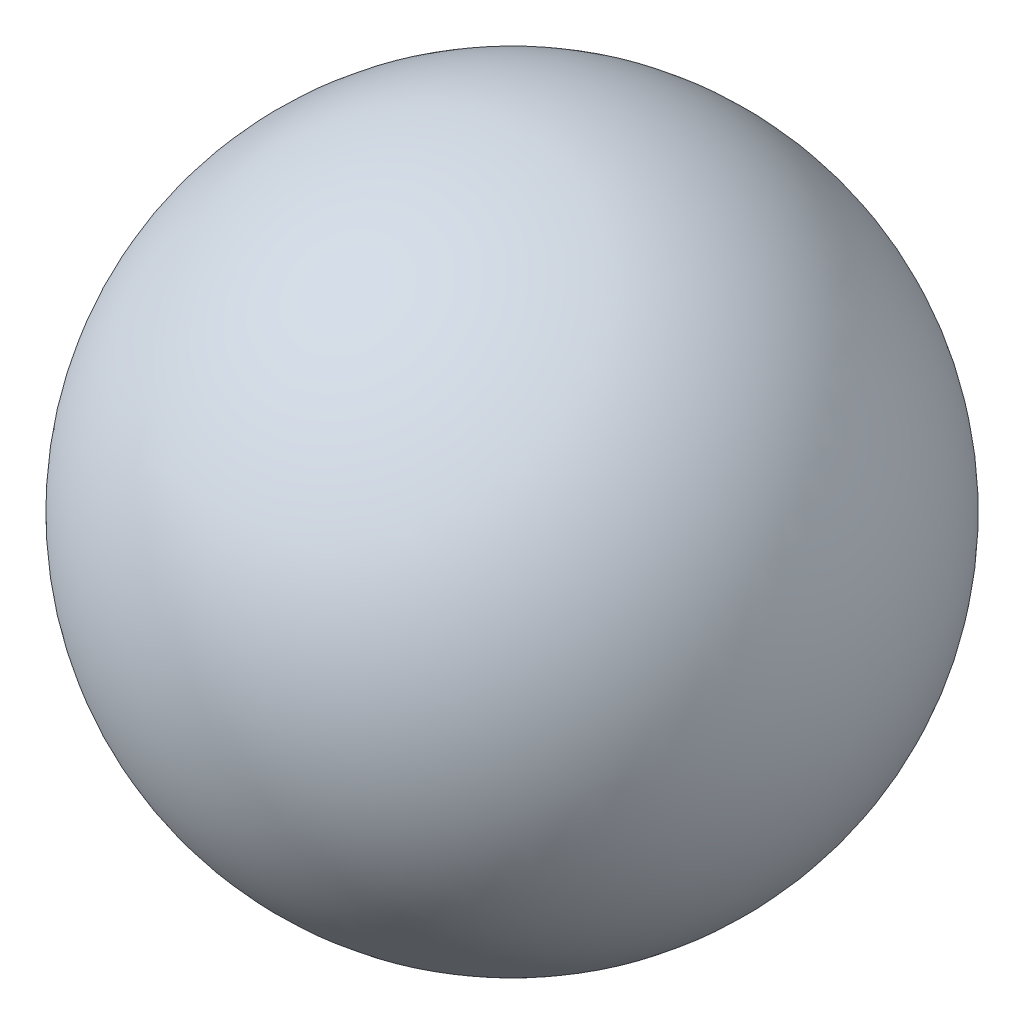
from build123d import *


with BuildPart() as part:
    # Esquisse1 → Base-R_volution (revolve)
    with BuildSketch(Plane.XY):
        with BuildLine():
            Line((0, 5), (0, 9))
            ThreePointArc((0, 9), (2, 7), (0, 5))
        make_face()
    revolve(axis=Axis((0, 18.394760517, 0), (0, -1, 0)))


solid = part.part
